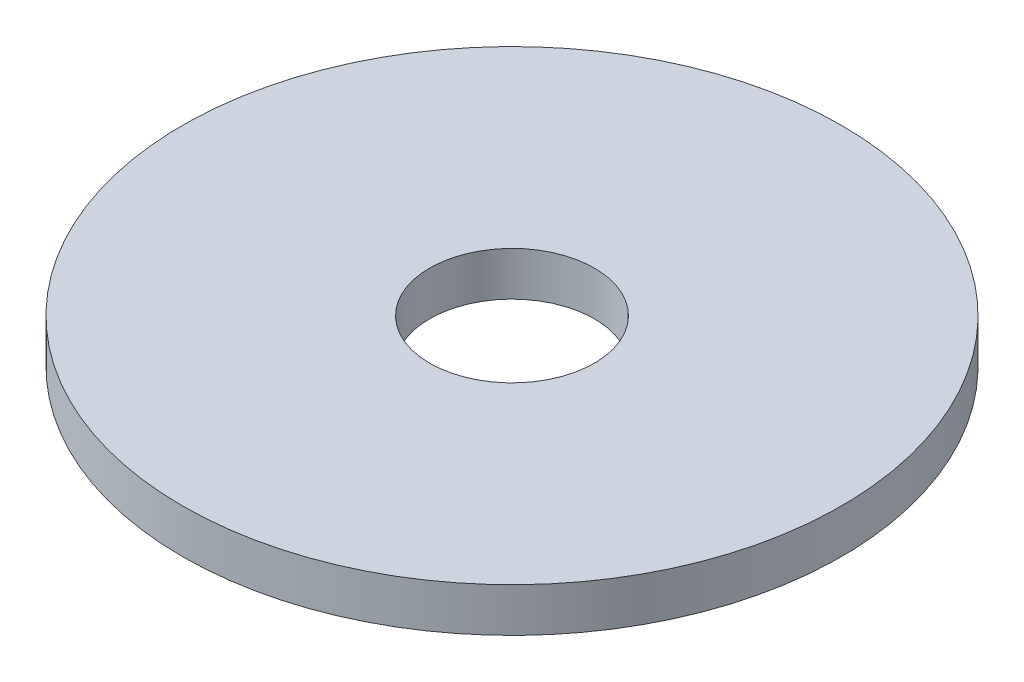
from build123d import *

# Parameters (mm, degrees)
ESQUISSE1_R      = 6
ESQUISSE1_R_2    = 1.5
EXTRUSION1_DEPTH = 0.8


with BuildPart() as part:
    # Esquisse1 → Extrusion1 (new body)
    with BuildSketch(Plane(origin=(0, 0, 0), x_dir=(1, 0, 0), z_dir=(0, 1, 0))):
        with Locations(Location((0, 0, 0), (0, 0, 270))):
            Circle(ESQUISSE1_R)
        with Locations(Location((0, 0, 0), (0, 0, 270))):
            Circle(ESQUISSE1_R_2, mode=Mode.SUBTRACT)
    extrude(amount=EXTRUSION1_DEPTH)


solid = part.part
